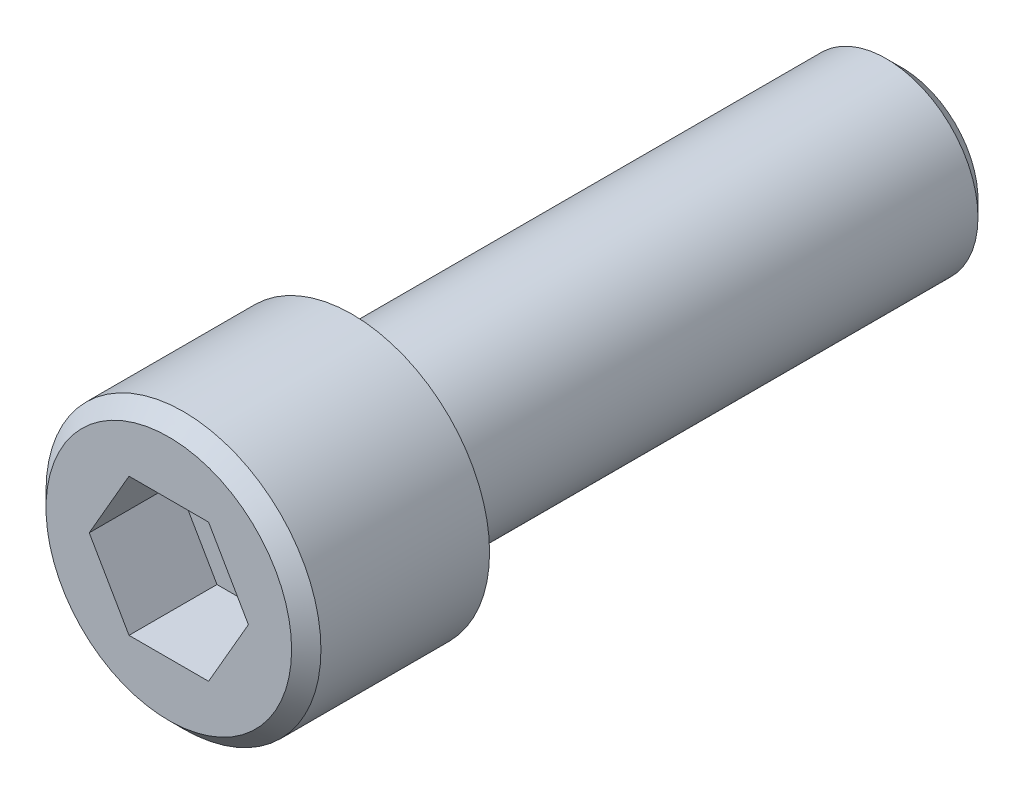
ISO-10303-21;
HEADER;
FILE_DESCRIPTION(('STEP AP214'),'2;1');
FILE_NAME('part.step','',(''),(''),'','','');
FILE_SCHEMA(('AUTOMOTIVE_DESIGN { 1 0 10303 214 1 1 1 1 }'));
ENDSEC;
DATA;
#1=APPLICATION_CONTEXT('core data for automotive mechanical design processes');
#2=APPLICATION_PROTOCOL_DEFINITION('international standard','automotive_design',2000,#1);
#3=PRODUCT_CONTEXT('',#1,'mechanical');
#4=PRODUCT('Part','Part','',(#3));
#5=PRODUCT_RELATED_PRODUCT_CATEGORY('part','',(#4));
#6=PRODUCT_DEFINITION_FORMATION('','',#4);
#7=PRODUCT_DEFINITION_CONTEXT('part definition',#1,'design');
#8=PRODUCT_DEFINITION('design','',#6,#7);
#9=PRODUCT_DEFINITION_SHAPE('','',#8);
#10=(LENGTH_UNIT() NAMED_UNIT(*) SI_UNIT(.MILLI.,.METRE.));
#11=(NAMED_UNIT(*) PLANE_ANGLE_UNIT() SI_UNIT($,.RADIAN.));
#12=(NAMED_UNIT(*) SI_UNIT($,.STERADIAN.) SOLID_ANGLE_UNIT());
#13=UNCERTAINTY_MEASURE_WITH_UNIT(LENGTH_MEASURE(1.E-05),#10,'distance_accuracy_value','');
#14=(GEOMETRIC_REPRESENTATION_CONTEXT(3) GLOBAL_UNCERTAINTY_ASSIGNED_CONTEXT((#13)) GLOBAL_UNIT_ASSIGNED_CONTEXT((#10,
#11,#12)) REPRESENTATION_CONTEXT('',''));
#15=CARTESIAN_POINT('',(0.,0.,0.));
#16=DIRECTION('',(0.,0.,1.));
#17=DIRECTION('',(1.,0.,0.));
#18=AXIS2_PLACEMENT_3D('',#15,#16,#17);
#19=CARTESIAN_POINT('',(0.,0.,-19.05));
#20=DIRECTION('',(0.,0.,1.));
#21=DIRECTION('',(1.,0.,0.));
#22=AXIS2_PLACEMENT_3D('',#19,#20,#21);
#23=CYLINDRICAL_SURFACE('',#22,3.175);
#24=CARTESIAN_POINT('',(0.,0.,0.));
#25=DIRECTION('',(0.,0.,1.));
#26=DIRECTION('',(1.,0.,0.));
#27=AXIS2_PLACEMENT_3D('',#24,#25,#26);
#28=CIRCLE('',#27,3.175);
#29=CARTESIAN_POINT('',(3.175,0.,0.));
#30=VERTEX_POINT('',#29);
#31=EDGE_CURVE('E12',#30,#30,#28,.F.);
#32=CARTESIAN_POINT('',(0.,0.,-18.5087025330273));
#33=DIRECTION('',(0.,0.,1.));
#34=DIRECTION('',(1.,0.,0.));
#35=AXIS2_PLACEMENT_3D('',#32,#33,#34);
#36=CIRCLE('',#35,3.175);
#37=CARTESIAN_POINT('',(3.175,0.,-18.5087025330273));
#38=VERTEX_POINT('',#37);
#39=EDGE_CURVE('E125',#38,#38,#36,.F.);
#40=CARTESIAN_POINT('',(3.175,0.,0.));
#41=CARTESIAN_POINT('',(3.175,0.,-0.192798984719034));
#42=CARTESIAN_POINT('',(3.175,0.,-0.385597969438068));
#43=CARTESIAN_POINT('',(3.175,0.,-0.771195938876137));
#44=CARTESIAN_POINT('',(3.175,0.,-0.963994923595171));
#45=CARTESIAN_POINT('',(3.175,0.,-1.34959289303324));
#46=CARTESIAN_POINT('',(3.175,0.,-1.54239187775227));
#47=CARTESIAN_POINT('',(3.175,0.,-1.92798984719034));
#48=CARTESIAN_POINT('',(3.175,0.,-2.12078883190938));
#49=CARTESIAN_POINT('',(3.175,0.,-2.50638680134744));
#50=CARTESIAN_POINT('',(3.175,0.,-2.69918578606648));
#51=CARTESIAN_POINT('',(3.175,0.,-3.08478375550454));
#52=CARTESIAN_POINT('',(3.175,0.,-3.27758274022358));
#53=CARTESIAN_POINT('',(3.175,0.,-3.66318070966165));
#54=CARTESIAN_POINT('',(3.175,0.,-3.85597969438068));
#55=CARTESIAN_POINT('',(3.175,0.,-4.24157766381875));
#56=CARTESIAN_POINT('',(3.175,0.,-4.43437664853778));
#57=CARTESIAN_POINT('',(3.175,0.,-4.81997461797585));
#58=CARTESIAN_POINT('',(3.175,0.,-5.01277360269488));
#59=CARTESIAN_POINT('',(3.175,0.,-5.39837157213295));
#60=CARTESIAN_POINT('',(3.175,0.,-5.59117055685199));
#61=CARTESIAN_POINT('',(3.175,0.,-5.97676852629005));
#62=CARTESIAN_POINT('',(3.175,0.,-6.16956751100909));
#63=CARTESIAN_POINT('',(3.175,0.,-6.55516548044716));
#64=CARTESIAN_POINT('',(3.175,0.,-6.74796446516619));
#65=CARTESIAN_POINT('',(3.175,0.,-7.13356243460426));
#66=CARTESIAN_POINT('',(3.175,0.,-7.32636141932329));
#67=CARTESIAN_POINT('',(3.175,0.,-7.71195938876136));
#68=CARTESIAN_POINT('',(3.175,0.,-7.90475837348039));
#69=CARTESIAN_POINT('',(3.175,0.,-8.29035634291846));
#70=CARTESIAN_POINT('',(3.175,0.,-8.4831553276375));
#71=CARTESIAN_POINT('',(3.175,0.,-8.86875329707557));
#72=CARTESIAN_POINT('',(3.175,0.,-9.0615522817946));
#73=CARTESIAN_POINT('',(3.175,0.,-9.44715025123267));
#74=CARTESIAN_POINT('',(3.175,0.,-9.6399492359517));
#75=CARTESIAN_POINT('',(3.175,0.,-10.0255472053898));
#76=CARTESIAN_POINT('',(3.175,0.,-10.2183461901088));
#77=CARTESIAN_POINT('',(3.175,0.,-10.6039441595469));
#78=CARTESIAN_POINT('',(3.175,0.,-10.7967431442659));
#79=CARTESIAN_POINT('',(3.175,0.,-11.182341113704));
#80=CARTESIAN_POINT('',(3.175,0.,-11.375140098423));
#81=CARTESIAN_POINT('',(3.175,0.,-11.7607380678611));
#82=CARTESIAN_POINT('',(3.175,0.,-11.9535370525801));
#83=CARTESIAN_POINT('',(3.175,0.,-12.3391350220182));
#84=CARTESIAN_POINT('',(3.175,0.,-12.5319340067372));
#85=CARTESIAN_POINT('',(3.175,0.,-12.9175319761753));
#86=CARTESIAN_POINT('',(3.175,0.,-13.1103309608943));
#87=CARTESIAN_POINT('',(3.175,0.,-13.4959289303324));
#88=CARTESIAN_POINT('',(3.175,0.,-13.6887279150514));
#89=CARTESIAN_POINT('',(3.175,0.,-14.0743258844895));
#90=CARTESIAN_POINT('',(3.175,0.,-14.2671248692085));
#91=CARTESIAN_POINT('',(3.175,0.,-14.6527228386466));
#92=CARTESIAN_POINT('',(3.175,0.,-14.8455218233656));
#93=CARTESIAN_POINT('',(3.175,0.,-15.2311197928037));
#94=CARTESIAN_POINT('',(3.175,0.,-15.4239187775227));
#95=CARTESIAN_POINT('',(3.175,0.,-15.8095167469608));
#96=CARTESIAN_POINT('',(3.175,0.,-16.0023157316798));
#97=CARTESIAN_POINT('',(3.175,0.,-16.3879137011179));
#98=CARTESIAN_POINT('',(3.175,0.,-16.5807126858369));
#99=CARTESIAN_POINT('',(3.175,0.,-16.966310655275));
#100=CARTESIAN_POINT('',(3.175,0.,-17.159109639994));
#101=CARTESIAN_POINT('',(3.175,0.,-17.5447076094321));
#102=CARTESIAN_POINT('',(3.175,0.,-17.7375065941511));
#103=CARTESIAN_POINT('',(3.175,0.,-18.1231045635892));
#104=CARTESIAN_POINT('',(3.175,0.,-18.3159035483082));
#105=CARTESIAN_POINT('',(3.175,0.,-18.5087025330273));
#106=B_SPLINE_CURVE_WITH_KNOTS('',3,(#40,#41,#42,#43,#44,#45,#46,#47,#48,#49,#50,#51,#52,#53,
#54,#55,#56,#57,#58,#59,#60,#61,#62,#63,#64,#65,#66,#67,#68,#69,#70,#71,#72,#73,#74,#75,#76,#77,
#78,#79,#80,#81,#82,#83,#84,#85,#86,#87,#88,#89,#90,#91,#92,#93,#94,#95,#96,#97,#98,#99,#100,
#101,#102,#103,#104,#105),.UNSPECIFIED.,.F.,.F.,(4,2,2,2,2,2,2,2,2,2,2,2,2,2,2,2,2,2,2,2,2,2,2,
2,2,2,2,2,2,2,2,2,4),(0.,0.578396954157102,1.1567939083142,1.73519086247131,2.31358781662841,
2.89198477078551,3.47038172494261,4.04877867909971,4.62717563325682,5.20557258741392,
5.78396954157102,6.36236649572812,6.94076344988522,7.51916040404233,8.09755735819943,
8.67595431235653,9.25435126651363,9.83274822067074,10.4111451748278,10.9895421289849,
11.567939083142,12.1463360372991,12.7247329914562,13.3031299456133,13.8815268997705,
14.4599238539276,15.0383208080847,15.6167177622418,16.1951147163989,16.773511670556,
17.3519086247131,17.9303055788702,18.5087025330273),.UNSPECIFIED.);
#107=EDGE_CURVE('BSEAM35',#30,#38,#106,.T.);
#108=ORIENTED_EDGE('',*,*,#31,.T.);
#109=ORIENTED_EDGE('',*,*,#39,.F.);
#110=ORIENTED_EDGE('',*,*,#107,.T.);
#111=ORIENTED_EDGE('',*,*,#107,.F.);
#112=EDGE_LOOP('',(#108,#110,#109,#111));
#113=FACE_BOUND('',#112,.T.);
#114=ADVANCED_FACE('F35',(#113),#23,.T.);
#115=CARTESIAN_POINT('',(0.,0.,6.35));
#116=DIRECTION('',(0.,0.,-1.));
#117=DIRECTION('',(-1.,0.,0.));
#118=AXIS2_PLACEMENT_3D('',#115,#116,#117);
#119=CYLINDRICAL_SURFACE('',#118,4.7625);
#120=CARTESIAN_POINT('',(0.,0.,5.842));
#121=DIRECTION('',(0.,0.,1.));
#122=DIRECTION('',(1.,0.,0.));
#123=AXIS2_PLACEMENT_3D('',#120,#121,#122);
#124=CIRCLE('',#123,4.7625);
#125=CARTESIAN_POINT('',(4.7625,0.,5.842));
#126=VERTEX_POINT('',#125);
#127=EDGE_CURVE('E43',#126,#126,#124,.F.);
#128=ORIENTED_EDGE('',*,*,#127,.T.);
#129=EDGE_LOOP('',(#128));
#130=FACE_BOUND('',#129,.T.);
#131=CARTESIAN_POINT('',(0.,0.,0.));
#132=DIRECTION('',(0.,0.,1.));
#133=DIRECTION('',(1.,0.,0.));
#134=AXIS2_PLACEMENT_3D('',#131,#132,#133);
#135=CIRCLE('',#134,4.7625);
#136=CARTESIAN_POINT('',(4.7625,0.,0.));
#137=VERTEX_POINT('',#136);
#138=EDGE_CURVE('E138',#137,#137,#135,.T.);
#139=ORIENTED_EDGE('',*,*,#138,.T.);
#140=EDGE_LOOP('',(#139));
#141=FACE_BOUND('',#140,.T.);
#142=ADVANCED_FACE('F151',(#130,#141),#119,.T.);
#143=CARTESIAN_POINT('',(0.,0.,6.35));
#144=DIRECTION('',(0.,0.,1.));
#145=DIRECTION('',(1.,0.,0.));
#146=AXIS2_PLACEMENT_3D('',#143,#144,#145);
#147=PLANE('',#146);
#148=DIRECTION('',(-0.5,-0.866025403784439,0.));
#149=VECTOR('',#148,1.);
#150=CARTESIAN_POINT('',(-1.37848150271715,2.3876,6.35));
#151=LINE('',#150,#149);
#152=CARTESIAN_POINT('',(-1.37848150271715,2.3876,6.35));
#153=VERTEX_POINT('',#152);
#154=CARTESIAN_POINT('',(-2.7569630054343,0.,6.35));
#155=VERTEX_POINT('',#154);
#156=EDGE_CURVE('E50',#153,#155,#151,.T.);
#157=ORIENTED_EDGE('',*,*,#156,.F.);
#158=DIRECTION('',(-1.,0.,0.));
#159=VECTOR('',#158,1.);
#160=CARTESIAN_POINT('',(1.37848150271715,2.3876,6.35));
#161=LINE('',#160,#159);
#162=CARTESIAN_POINT('',(1.37848150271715,2.3876,6.35));
#163=VERTEX_POINT('',#162);
#164=EDGE_CURVE('E134',#163,#153,#161,.T.);
#165=ORIENTED_EDGE('',*,*,#164,.F.);
#166=DIRECTION('',(-0.5,0.866025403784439,0.));
#167=VECTOR('',#166,1.);
#168=CARTESIAN_POINT('',(2.7569630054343,0.,6.35));
#169=LINE('',#168,#167);
#170=CARTESIAN_POINT('',(2.7569630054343,0.,6.35));
#171=VERTEX_POINT('',#170);
#172=EDGE_CURVE('E132',#171,#163,#169,.T.);
#173=ORIENTED_EDGE('',*,*,#172,.F.);
#174=DIRECTION('',(0.5,0.866025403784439,0.));
#175=VECTOR('',#174,1.);
#176=CARTESIAN_POINT('',(1.37848150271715,-2.3876,6.35));
#177=LINE('',#176,#175);
#178=CARTESIAN_POINT('',(1.37848150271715,-2.3876,6.35));
#179=VERTEX_POINT('',#178);
#180=EDGE_CURVE('E98',#179,#171,#177,.T.);
#181=ORIENTED_EDGE('',*,*,#180,.F.);
#182=DIRECTION('',(1.,0.,0.));
#183=VECTOR('',#182,1.);
#184=CARTESIAN_POINT('',(-1.37848150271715,-2.3876,6.35));
#185=LINE('',#184,#183);
#186=CARTESIAN_POINT('',(-1.37848150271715,-2.3876,6.35));
#187=VERTEX_POINT('',#186);
#188=EDGE_CURVE('E128',#187,#179,#185,.T.);
#189=ORIENTED_EDGE('',*,*,#188,.F.);
#190=DIRECTION('',(0.5,-0.866025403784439,0.));
#191=VECTOR('',#190,1.);
#192=CARTESIAN_POINT('',(-2.7569630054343,0.,6.35));
#193=LINE('',#192,#191);
#194=EDGE_CURVE('E124',#155,#187,#193,.T.);
#195=ORIENTED_EDGE('',*,*,#194,.F.);
#196=EDGE_LOOP('',(#157,#165,#173,#181,#189,#195));
#197=FACE_BOUND('',#196,.T.);
#198=CARTESIAN_POINT('',(0.,0.,6.35));
#199=DIRECTION('',(0.,0.,1.));
#200=DIRECTION('',(1.,0.,0.));
#201=AXIS2_PLACEMENT_3D('',#198,#199,#200);
#202=CIRCLE('',#201,4.2545);
#203=CARTESIAN_POINT('',(4.2545,0.,6.35));
#204=VERTEX_POINT('',#203);
#205=EDGE_CURVE('E146',#204,#204,#202,.T.);
#206=ORIENTED_EDGE('',*,*,#205,.T.);
#207=EDGE_LOOP('',(#206));
#208=FACE_BOUND('',#207,.T.);
#209=ADVANCED_FACE('F160',(#197,#208),#147,.T.);
#210=CARTESIAN_POINT('',(0.,0.,0.));
#211=DIRECTION('',(0.,0.,1.));
#212=DIRECTION('',(1.,0.,0.));
#213=AXIS2_PLACEMENT_3D('',#210,#211,#212);
#214=PLANE('',#213);
#215=ORIENTED_EDGE('',*,*,#31,.F.);
#216=EDGE_LOOP('',(#215));
#217=FACE_BOUND('',#216,.T.);
#218=ORIENTED_EDGE('',*,*,#138,.F.);
#219=EDGE_LOOP('',(#218));
#220=FACE_BOUND('',#219,.T.);
#221=ADVANCED_FACE('F157',(#217,#220),#214,.F.);
#222=CARTESIAN_POINT('',(0.,0.,6.35));
#223=DIRECTION('',(0.,0.,-1.));
#224=DIRECTION('',(-1.,0.,0.));
#225=AXIS2_PLACEMENT_3D('',#222,#223,#224);
#226=CONICAL_SURFACE('',#225,4.2545,0.785398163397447);
#227=ORIENTED_EDGE('',*,*,#127,.F.);
#228=EDGE_LOOP('',(#227));
#229=FACE_BOUND('',#228,.T.);
#230=ORIENTED_EDGE('',*,*,#205,.F.);
#231=EDGE_LOOP('',(#230));
#232=FACE_BOUND('',#231,.T.);
#233=ADVANCED_FACE('F37',(#229,#232),#226,.T.);
#234=CARTESIAN_POINT('',(-1.37848150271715,2.3876,3.302));
#235=DIRECTION('',(-0.866025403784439,0.5,0.));
#236=DIRECTION('',(-0.5,-0.866025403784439,0.));
#237=AXIS2_PLACEMENT_3D('',#234,#235,#236);
#238=PLANE('',#237);
#239=ORIENTED_EDGE('',*,*,#156,.T.);
#240=DIRECTION('',(0.,0.,1.));
#241=VECTOR('',#240,1.);
#242=CARTESIAN_POINT('',(-2.7569630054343,0.,3.302));
#243=LINE('',#242,#241);
#244=CARTESIAN_POINT('',(-2.7569630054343,0.,3.302));
#245=VERTEX_POINT('',#244);
#246=EDGE_CURVE('E80',#245,#155,#243,.T.);
#247=ORIENTED_EDGE('',*,*,#246,.F.);
#248=DIRECTION('',(-0.5,-0.866025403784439,0.));
#249=VECTOR('',#248,1.);
#250=CARTESIAN_POINT('',(-1.37848150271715,2.3876,3.302));
#251=LINE('',#250,#249);
#252=CARTESIAN_POINT('',(-1.37848150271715,2.3876,3.302));
#253=VERTEX_POINT('',#252);
#254=EDGE_CURVE('E136',#253,#245,#251,.T.);
#255=ORIENTED_EDGE('',*,*,#254,.F.);
#256=DIRECTION('',(0.,0.,1.));
#257=VECTOR('',#256,1.);
#258=CARTESIAN_POINT('',(-1.37848150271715,2.3876,3.302));
#259=LINE('',#258,#257);
#260=EDGE_CURVE('E58',#253,#153,#259,.T.);
#261=ORIENTED_EDGE('',*,*,#260,.T.);
#262=EDGE_LOOP('',(#239,#247,#255,#261));
#263=FACE_BOUND('',#262,.T.);
#264=ADVANCED_FACE('F156',(#263),#238,.F.);
#265=CARTESIAN_POINT('',(1.37848150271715,2.3876,3.302));
#266=DIRECTION('',(0.,1.,0.));
#267=DIRECTION('',(0.,0.,1.));
#268=AXIS2_PLACEMENT_3D('',#265,#266,#267);
#269=PLANE('',#268);
#270=ORIENTED_EDGE('',*,*,#164,.T.);
#271=ORIENTED_EDGE('',*,*,#260,.F.);
#272=DIRECTION('',(-1.,0.,0.));
#273=VECTOR('',#272,1.);
#274=CARTESIAN_POINT('',(1.37848150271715,2.3876,3.302));
#275=LINE('',#274,#273);
#276=CARTESIAN_POINT('',(1.37848150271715,2.3876,3.302));
#277=VERTEX_POINT('',#276);
#278=EDGE_CURVE('E110',#277,#253,#275,.T.);
#279=ORIENTED_EDGE('',*,*,#278,.F.);
#280=DIRECTION('',(0.,0.,1.));
#281=VECTOR('',#280,1.);
#282=CARTESIAN_POINT('',(1.37848150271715,2.3876,3.302));
#283=LINE('',#282,#281);
#284=EDGE_CURVE('E102',#277,#163,#283,.T.);
#285=ORIENTED_EDGE('',*,*,#284,.T.);
#286=EDGE_LOOP('',(#270,#271,#279,#285));
#287=FACE_BOUND('',#286,.T.);
#288=ADVANCED_FACE('F185',(#287),#269,.F.);
#289=CARTESIAN_POINT('',(2.7569630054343,0.,3.302));
#290=DIRECTION('',(0.866025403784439,0.5,0.));
#291=DIRECTION('',(-0.5,0.866025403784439,0.));
#292=AXIS2_PLACEMENT_3D('',#289,#290,#291);
#293=PLANE('',#292);
#294=ORIENTED_EDGE('',*,*,#172,.T.);
#295=ORIENTED_EDGE('',*,*,#284,.F.);
#296=DIRECTION('',(-0.5,0.866025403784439,0.));
#297=VECTOR('',#296,1.);
#298=CARTESIAN_POINT('',(2.7569630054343,0.,3.302));
#299=LINE('',#298,#297);
#300=CARTESIAN_POINT('',(2.7569630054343,0.,3.302));
#301=VERTEX_POINT('',#300);
#302=EDGE_CURVE('E106',#301,#277,#299,.T.);
#303=ORIENTED_EDGE('',*,*,#302,.F.);
#304=DIRECTION('',(0.,0.,1.));
#305=VECTOR('',#304,1.);
#306=CARTESIAN_POINT('',(2.7569630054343,0.,3.302));
#307=LINE('',#306,#305);
#308=EDGE_CURVE('E91',#301,#171,#307,.T.);
#309=ORIENTED_EDGE('',*,*,#308,.T.);
#310=EDGE_LOOP('',(#294,#295,#303,#309));
#311=FACE_BOUND('',#310,.T.);
#312=ADVANCED_FACE('F107',(#311),#293,.F.);
#313=CARTESIAN_POINT('',(1.37848150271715,-2.3876,3.302));
#314=DIRECTION('',(0.866025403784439,-0.5,0.));
#315=DIRECTION('',(0.5,0.866025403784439,0.));
#316=AXIS2_PLACEMENT_3D('',#313,#314,#315);
#317=PLANE('',#316);
#318=ORIENTED_EDGE('',*,*,#180,.T.);
#319=ORIENTED_EDGE('',*,*,#308,.F.);
#320=DIRECTION('',(0.5,0.866025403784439,0.));
#321=VECTOR('',#320,1.);
#322=CARTESIAN_POINT('',(1.37848150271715,-2.3876,3.302));
#323=LINE('',#322,#321);
#324=CARTESIAN_POINT('',(1.37848150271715,-2.3876,3.302));
#325=VERTEX_POINT('',#324);
#326=EDGE_CURVE('E95',#325,#301,#323,.T.);
#327=ORIENTED_EDGE('',*,*,#326,.F.);
#328=DIRECTION('',(0.,0.,1.));
#329=VECTOR('',#328,1.);
#330=CARTESIAN_POINT('',(1.37848150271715,-2.3876,3.302));
#331=LINE('',#330,#329);
#332=EDGE_CURVE('E103',#325,#179,#331,.T.);
#333=ORIENTED_EDGE('',*,*,#332,.T.);
#334=EDGE_LOOP('',(#318,#319,#327,#333));
#335=FACE_BOUND('',#334,.T.);
#336=ADVANCED_FACE('F93',(#335),#317,.F.);
#337=CARTESIAN_POINT('',(-1.37848150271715,-2.3876,3.302));
#338=DIRECTION('',(0.,-1.,0.));
#339=DIRECTION('',(1.,0.,0.));
#340=AXIS2_PLACEMENT_3D('',#337,#338,#339);
#341=PLANE('',#340);
#342=ORIENTED_EDGE('',*,*,#188,.T.);
#343=ORIENTED_EDGE('',*,*,#332,.F.);
#344=DIRECTION('',(1.,0.,0.));
#345=VECTOR('',#344,1.);
#346=CARTESIAN_POINT('',(-1.37848150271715,-2.3876,3.302));
#347=LINE('',#346,#345);
#348=CARTESIAN_POINT('',(-1.37848150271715,-2.3876,3.302));
#349=VERTEX_POINT('',#348);
#350=EDGE_CURVE('E116',#349,#325,#347,.T.);
#351=ORIENTED_EDGE('',*,*,#350,.F.);
#352=DIRECTION('',(0.,0.,1.));
#353=VECTOR('',#352,1.);
#354=CARTESIAN_POINT('',(-1.37848150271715,-2.3876,3.302));
#355=LINE('',#354,#353);
#356=EDGE_CURVE('E141',#349,#187,#355,.T.);
#357=ORIENTED_EDGE('',*,*,#356,.T.);
#358=EDGE_LOOP('',(#342,#343,#351,#357));
#359=FACE_BOUND('',#358,.T.);
#360=ADVANCED_FACE('F192',(#359),#341,.F.);
#361=CARTESIAN_POINT('',(-2.7569630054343,0.,3.302));
#362=DIRECTION('',(-0.866025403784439,-0.5,0.));
#363=DIRECTION('',(0.5,-0.866025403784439,0.));
#364=AXIS2_PLACEMENT_3D('',#361,#362,#363);
#365=PLANE('',#364);
#366=ORIENTED_EDGE('',*,*,#194,.T.);
#367=ORIENTED_EDGE('',*,*,#356,.F.);
#368=DIRECTION('',(0.5,-0.866025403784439,0.));
#369=VECTOR('',#368,1.);
#370=CARTESIAN_POINT('',(-2.7569630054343,0.,3.302));
#371=LINE('',#370,#369);
#372=EDGE_CURVE('E118',#245,#349,#371,.T.);
#373=ORIENTED_EDGE('',*,*,#372,.F.);
#374=ORIENTED_EDGE('',*,*,#246,.T.);
#375=EDGE_LOOP('',(#366,#367,#373,#374));
#376=FACE_BOUND('',#375,.T.);
#377=ADVANCED_FACE('F184',(#376),#365,.F.);
#378=CARTESIAN_POINT('',(0.,0.,3.302));
#379=DIRECTION('',(0.,0.,1.));
#380=DIRECTION('',(1.,0.,0.));
#381=AXIS2_PLACEMENT_3D('',#378,#379,#380);
#382=PLANE('',#381);
#383=ORIENTED_EDGE('',*,*,#254,.T.);
#384=ORIENTED_EDGE('',*,*,#372,.T.);
#385=ORIENTED_EDGE('',*,*,#350,.T.);
#386=ORIENTED_EDGE('',*,*,#326,.T.);
#387=ORIENTED_EDGE('',*,*,#302,.T.);
#388=ORIENTED_EDGE('',*,*,#278,.T.);
#389=EDGE_LOOP('',(#383,#384,#385,#386,#387,#388));
#390=FACE_BOUND('',#389,.T.);
#391=ADVANCED_FACE('F113',(#390),#382,.T.);
#392=CARTESIAN_POINT('',(0.,0.,-19.05));
#393=DIRECTION('',(0.,0.,1.));
#394=DIRECTION('',(-1.,0.,0.));
#395=AXIS2_PLACEMENT_3D('',#392,#393,#394);
#396=CONICAL_SURFACE('',#395,2.63370253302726,0.78539816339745);
#397=CARTESIAN_POINT('',(0.,0.,-19.05));
#398=DIRECTION('',(0.,0.,-1.));
#399=DIRECTION('',(-1.,0.,0.));
#400=AXIS2_PLACEMENT_3D('',#397,#398,#399);
#401=CIRCLE('',#400,2.63370253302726);
#402=CARTESIAN_POINT('',(-2.63370253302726,0.,-19.05));
#403=VERTEX_POINT('',#402);
#404=EDGE_CURVE('E287',#403,#403,#401,.T.);
#405=ORIENTED_EDGE('',*,*,#404,.F.);
#406=EDGE_LOOP('',(#405));
#407=FACE_BOUND('',#406,.T.);
#408=ORIENTED_EDGE('',*,*,#39,.T.);
#409=EDGE_LOOP('',(#408));
#410=FACE_BOUND('',#409,.T.);
#411=ADVANCED_FACE('F183',(#407,#410),#396,.T.);
#412=CARTESIAN_POINT('',(0.,0.,-19.05));
#413=DIRECTION('',(0.,0.,-1.));
#414=DIRECTION('',(-1.,0.,0.));
#415=AXIS2_PLACEMENT_3D('',#412,#413,#414);
#416=PLANE('',#415);
#417=ORIENTED_EDGE('',*,*,#404,.T.);
#418=EDGE_LOOP('',(#417));
#419=FACE_BOUND('',#418,.T.);
#420=ADVANCED_FACE('F179',(#419),#416,.T.);
#421=CLOSED_SHELL('',(#114,#142,#209,#221,#233,#264,#288,#312,#336,#360,#377,#391,#411,#420));
#422=MANIFOLD_SOLID_BREP('B2',#421);
#423=ADVANCED_BREP_SHAPE_REPRESENTATION('',(#18,#422),#14);
#424=SHAPE_DEFINITION_REPRESENTATION(#9,#423);
ENDSEC;
END-ISO-10303-21;
